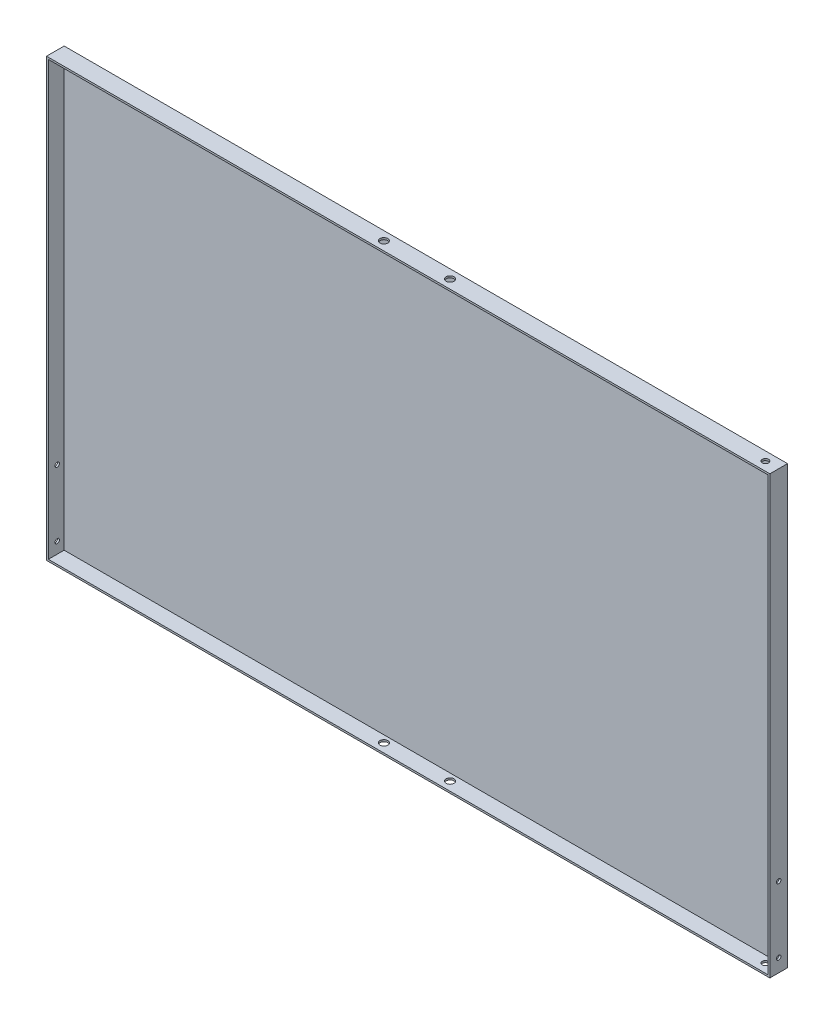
ISO-10303-21;
HEADER;
FILE_DESCRIPTION(('STEP AP214'),'2;1');
FILE_NAME('part.step','',(''),(''),'','','');
FILE_SCHEMA(('AUTOMOTIVE_DESIGN { 1 0 10303 214 1 1 1 1 }'));
ENDSEC;
DATA;
#1=APPLICATION_CONTEXT('core data for automotive mechanical design processes');
#2=APPLICATION_PROTOCOL_DEFINITION('international standard','automotive_design',2000,#1);
#3=PRODUCT_CONTEXT('',#1,'mechanical');
#4=PRODUCT('Part','Part','',(#3));
#5=PRODUCT_RELATED_PRODUCT_CATEGORY('part','',(#4));
#6=PRODUCT_DEFINITION_FORMATION('','',#4);
#7=PRODUCT_DEFINITION_CONTEXT('part definition',#1,'design');
#8=PRODUCT_DEFINITION('design','',#6,#7);
#9=PRODUCT_DEFINITION_SHAPE('','',#8);
#10=(LENGTH_UNIT() NAMED_UNIT(*) SI_UNIT(.MILLI.,.METRE.));
#11=(NAMED_UNIT(*) PLANE_ANGLE_UNIT() SI_UNIT($,.RADIAN.));
#12=(NAMED_UNIT(*) SI_UNIT($,.STERADIAN.) SOLID_ANGLE_UNIT());
#13=UNCERTAINTY_MEASURE_WITH_UNIT(LENGTH_MEASURE(1.E-05),#10,'distance_accuracy_value','');
#14=(GEOMETRIC_REPRESENTATION_CONTEXT(3) GLOBAL_UNCERTAINTY_ASSIGNED_CONTEXT((#13)) GLOBAL_UNIT_ASSIGNED_CONTEXT((#10,
#11,#12)) REPRESENTATION_CONTEXT('',''));
#15=CARTESIAN_POINT('',(0.,0.,0.));
#16=DIRECTION('',(0.,0.,1.));
#17=DIRECTION('',(1.,0.,0.));
#18=AXIS2_PLACEMENT_3D('',#15,#16,#17);
#19=CARTESIAN_POINT('',(-820.,-495.,40.));
#20=DIRECTION('',(1.,0.,0.));
#21=DIRECTION('',(0.,0.,-1.));
#22=AXIS2_PLACEMENT_3D('',#19,#20,#21);
#23=PLANE('',#22);
#24=CARTESIAN_POINT('',(-820.,-315.,19.9999999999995));
#25=DIRECTION('',(1.,0.,0.));
#26=DIRECTION('',(0.,0.,-1.));
#27=AXIS2_PLACEMENT_3D('',#24,#25,#26);
#28=CIRCLE('',#27,5.);
#29=CARTESIAN_POINT('',(-820.,-315.,24.9999999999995));
#30=VERTEX_POINT('',#29);
#31=EDGE_CURVE('E185',#30,#30,#28,.T.);
#32=ORIENTED_EDGE('',*,*,#31,.T.);
#33=EDGE_LOOP('',(#32));
#34=FACE_BOUND('',#33,.T.);
#35=CARTESIAN_POINT('',(-820.,-465.,20.));
#36=DIRECTION('',(1.,0.,0.));
#37=DIRECTION('',(0.,0.,-1.));
#38=AXIS2_PLACEMENT_3D('',#35,#36,#37);
#39=CIRCLE('',#38,5.);
#40=CARTESIAN_POINT('',(-820.,-465.,25.));
#41=VERTEX_POINT('',#40);
#42=EDGE_CURVE('E182',#41,#41,#39,.T.);
#43=ORIENTED_EDGE('',*,*,#42,.T.);
#44=EDGE_LOOP('',(#43));
#45=FACE_BOUND('',#44,.T.);
#46=DIRECTION('',(0.,-1.,0.));
#47=VECTOR('',#46,1.);
#48=CARTESIAN_POINT('',(-820.,-495.,0.));
#49=LINE('',#48,#47);
#50=CARTESIAN_POINT('',(-820.,495.,0.));
#51=VERTEX_POINT('',#50);
#52=CARTESIAN_POINT('',(-820.,-495.,0.));
#53=VERTEX_POINT('',#52);
#54=EDGE_CURVE('E149',#51,#53,#49,.T.);
#55=ORIENTED_EDGE('',*,*,#54,.T.);
#56=DIRECTION('',(0.,0.,-1.));
#57=VECTOR('',#56,1.);
#58=CARTESIAN_POINT('',(-820.,-495.,40.));
#59=LINE('',#58,#57);
#60=CARTESIAN_POINT('',(-820.,-495.,40.));
#61=VERTEX_POINT('',#60);
#62=EDGE_CURVE('E11',#61,#53,#59,.T.);
#63=ORIENTED_EDGE('',*,*,#62,.F.);
#64=DIRECTION('',(0.,-1.,0.));
#65=VECTOR('',#64,1.);
#66=CARTESIAN_POINT('',(-820.,-495.,40.));
#67=LINE('',#66,#65);
#68=CARTESIAN_POINT('',(-820.,495.,40.));
#69=VERTEX_POINT('',#68);
#70=EDGE_CURVE('E142',#69,#61,#67,.T.);
#71=ORIENTED_EDGE('',*,*,#70,.F.);
#72=DIRECTION('',(0.,0.,-1.));
#73=VECTOR('',#72,1.);
#74=CARTESIAN_POINT('',(-820.,495.,40.));
#75=LINE('',#74,#73);
#76=EDGE_CURVE('E148',#69,#51,#75,.T.);
#77=ORIENTED_EDGE('',*,*,#76,.T.);
#78=EDGE_LOOP('',(#55,#63,#71,#77));
#79=FACE_BOUND('',#78,.T.);
#80=ADVANCED_FACE('F33',(#34,#45,#79),#23,.F.);
#81=CARTESIAN_POINT('',(820.,-495.,40.));
#82=DIRECTION('',(0.,1.,0.));
#83=DIRECTION('',(-1.,0.,0.));
#84=AXIS2_PLACEMENT_3D('',#81,#82,#83);
#85=PLANE('',#84);
#86=CARTESIAN_POINT('',(-74.9999999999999,-495.,19.9999999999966));
#87=DIRECTION('',(0.,1.,0.));
#88=DIRECTION('',(-1.,0.,0.));
#89=AXIS2_PLACEMENT_3D('',#86,#87,#88);
#90=CIRCLE('',#89,8.95251953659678);
#91=CARTESIAN_POINT('',(-83.9525195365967,-495.,19.9999999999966));
#92=VERTEX_POINT('',#91);
#93=EDGE_CURVE('E171',#92,#92,#90,.T.);
#94=ORIENTED_EDGE('',*,*,#93,.T.);
#95=EDGE_LOOP('',(#94));
#96=FACE_BOUND('',#95,.T.);
#97=CARTESIAN_POINT('',(75.0000000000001,-495.,19.9999999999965));
#98=DIRECTION('',(0.,1.,0.));
#99=DIRECTION('',(1.,0.,0.));
#100=AXIS2_PLACEMENT_3D('',#97,#98,#99);
#101=CIRCLE('',#100,8.95251953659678);
#102=CARTESIAN_POINT('',(83.9525195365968,-495.,19.9999999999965));
#103=VERTEX_POINT('',#102);
#104=EDGE_CURVE('E202',#103,#103,#101,.T.);
#105=ORIENTED_EDGE('',*,*,#104,.T.);
#106=EDGE_LOOP('',(#105));
#107=FACE_BOUND('',#106,.T.);
#108=CARTESIAN_POINT('',(790.,-495.,19.9999999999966));
#109=DIRECTION('',(0.,1.,0.));
#110=DIRECTION('',(-1.,0.,0.));
#111=AXIS2_PLACEMENT_3D('',#108,#109,#110);
#112=CIRCLE('',#111,7.18021218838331);
#113=CARTESIAN_POINT('',(782.819787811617,-495.,19.9999999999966));
#114=VERTEX_POINT('',#113);
#115=EDGE_CURVE('E166',#114,#114,#112,.T.);
#116=ORIENTED_EDGE('',*,*,#115,.T.);
#117=EDGE_LOOP('',(#116));
#118=FACE_BOUND('',#117,.T.);
#119=DIRECTION('',(1.,0.,0.));
#120=VECTOR('',#119,1.);
#121=CARTESIAN_POINT('',(820.,-495.,0.));
#122=LINE('',#121,#120);
#123=CARTESIAN_POINT('',(820.,-495.,0.));
#124=VERTEX_POINT('',#123);
#125=EDGE_CURVE('E152',#53,#124,#122,.T.);
#126=ORIENTED_EDGE('',*,*,#125,.T.);
#127=DIRECTION('',(0.,0.,-1.));
#128=VECTOR('',#127,1.);
#129=CARTESIAN_POINT('',(820.,-495.,40.));
#130=LINE('',#129,#128);
#131=CARTESIAN_POINT('',(820.,-495.,40.));
#132=VERTEX_POINT('',#131);
#133=EDGE_CURVE('E41',#132,#124,#130,.T.);
#134=ORIENTED_EDGE('',*,*,#133,.F.);
#135=DIRECTION('',(1.,0.,0.));
#136=VECTOR('',#135,1.);
#137=CARTESIAN_POINT('',(820.,-495.,40.));
#138=LINE('',#137,#136);
#139=EDGE_CURVE('E86',#61,#132,#138,.T.);
#140=ORIENTED_EDGE('',*,*,#139,.F.);
#141=ORIENTED_EDGE('',*,*,#62,.T.);
#142=EDGE_LOOP('',(#126,#134,#140,#141));
#143=FACE_BOUND('',#142,.T.);
#144=ADVANCED_FACE('F237',(#96,#107,#118,#143),#85,.F.);
#145=CARTESIAN_POINT('',(820.,-495.,40.));
#146=DIRECTION('',(-1.,0.,0.));
#147=DIRECTION('',(0.,0.,1.));
#148=AXIS2_PLACEMENT_3D('',#145,#146,#147);
#149=PLANE('',#148);
#150=CARTESIAN_POINT('',(820.,-315.,19.9999999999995));
#151=DIRECTION('',(-1.,0.,0.));
#152=DIRECTION('',(0.,0.,1.));
#153=AXIS2_PLACEMENT_3D('',#150,#151,#152);
#154=CIRCLE('',#153,5.);
#155=CARTESIAN_POINT('',(820.,-315.,24.9999999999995));
#156=VERTEX_POINT('',#155);
#157=EDGE_CURVE('E371',#156,#156,#154,.T.);
#158=ORIENTED_EDGE('',*,*,#157,.T.);
#159=EDGE_LOOP('',(#158));
#160=FACE_BOUND('',#159,.T.);
#161=CARTESIAN_POINT('',(820.,-465.,20.));
#162=DIRECTION('',(-1.,0.,0.));
#163=DIRECTION('',(0.,0.,1.));
#164=AXIS2_PLACEMENT_3D('',#161,#162,#163);
#165=CIRCLE('',#164,5.);
#166=CARTESIAN_POINT('',(820.,-465.,25.));
#167=VERTEX_POINT('',#166);
#168=EDGE_CURVE('E178',#167,#167,#165,.T.);
#169=ORIENTED_EDGE('',*,*,#168,.T.);
#170=EDGE_LOOP('',(#169));
#171=FACE_BOUND('',#170,.T.);
#172=DIRECTION('',(0.,1.,0.));
#173=VECTOR('',#172,1.);
#174=CARTESIAN_POINT('',(820.,-495.,0.));
#175=LINE('',#174,#173);
#176=CARTESIAN_POINT('',(820.,495.,0.));
#177=VERTEX_POINT('',#176);
#178=EDGE_CURVE('E154',#124,#177,#175,.T.);
#179=ORIENTED_EDGE('',*,*,#178,.T.);
#180=DIRECTION('',(0.,0.,-1.));
#181=VECTOR('',#180,1.);
#182=CARTESIAN_POINT('',(820.,495.,40.));
#183=LINE('',#182,#181);
#184=CARTESIAN_POINT('',(820.,495.,40.));
#185=VERTEX_POINT('',#184);
#186=EDGE_CURVE('E158',#185,#177,#183,.T.);
#187=ORIENTED_EDGE('',*,*,#186,.F.);
#188=DIRECTION('',(0.,1.,0.));
#189=VECTOR('',#188,1.);
#190=CARTESIAN_POINT('',(820.,-495.,40.));
#191=LINE('',#190,#189);
#192=EDGE_CURVE('E145',#132,#185,#191,.T.);
#193=ORIENTED_EDGE('',*,*,#192,.F.);
#194=ORIENTED_EDGE('',*,*,#133,.T.);
#195=EDGE_LOOP('',(#179,#187,#193,#194));
#196=FACE_BOUND('',#195,.T.);
#197=ADVANCED_FACE('F242',(#160,#171,#196),#149,.F.);
#198=CARTESIAN_POINT('',(820.,495.,40.));
#199=DIRECTION('',(0.,-1.,0.));
#200=DIRECTION('',(1.,0.,0.));
#201=AXIS2_PLACEMENT_3D('',#198,#199,#200);
#202=PLANE('',#201);
#203=CARTESIAN_POINT('',(-75.0000000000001,495.,19.9999999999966));
#204=DIRECTION('',(0.,1.,0.));
#205=DIRECTION('',(-1.,0.,0.));
#206=AXIS2_PLACEMENT_3D('',#203,#204,#205);
#207=CIRCLE('',#206,8.95251953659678);
#208=CARTESIAN_POINT('',(-83.9525195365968,495.,19.9999999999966));
#209=VERTEX_POINT('',#208);
#210=EDGE_CURVE('E199',#209,#209,#207,.T.);
#211=ORIENTED_EDGE('',*,*,#210,.F.);
#212=EDGE_LOOP('',(#211));
#213=FACE_BOUND('',#212,.T.);
#214=CARTESIAN_POINT('',(74.9999999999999,495.,19.9999999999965));
#215=DIRECTION('',(0.,1.,0.));
#216=DIRECTION('',(1.,0.,0.));
#217=AXIS2_PLACEMENT_3D('',#214,#215,#216);
#218=CIRCLE('',#217,8.95251953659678);
#219=CARTESIAN_POINT('',(83.9525195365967,495.,19.9999999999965));
#220=VERTEX_POINT('',#219);
#221=EDGE_CURVE('E196',#220,#220,#218,.T.);
#222=ORIENTED_EDGE('',*,*,#221,.F.);
#223=EDGE_LOOP('',(#222));
#224=FACE_BOUND('',#223,.T.);
#225=CARTESIAN_POINT('',(790.,495.,19.9999999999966));
#226=DIRECTION('',(0.,1.,0.));
#227=DIRECTION('',(-1.,0.,0.));
#228=AXIS2_PLACEMENT_3D('',#225,#226,#227);
#229=CIRCLE('',#228,7.18021218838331);
#230=CARTESIAN_POINT('',(782.819787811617,495.,19.9999999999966));
#231=VERTEX_POINT('',#230);
#232=EDGE_CURVE('E211',#231,#231,#229,.T.);
#233=ORIENTED_EDGE('',*,*,#232,.F.);
#234=EDGE_LOOP('',(#233));
#235=FACE_BOUND('',#234,.T.);
#236=DIRECTION('',(-1.,0.,0.));
#237=VECTOR('',#236,1.);
#238=CARTESIAN_POINT('',(820.,495.,0.));
#239=LINE('',#238,#237);
#240=EDGE_CURVE('E79',#177,#51,#239,.T.);
#241=ORIENTED_EDGE('',*,*,#240,.T.);
#242=ORIENTED_EDGE('',*,*,#76,.F.);
#243=DIRECTION('',(-1.,0.,0.));
#244=VECTOR('',#243,1.);
#245=CARTESIAN_POINT('',(820.,495.,40.));
#246=LINE('',#245,#244);
#247=EDGE_CURVE('E58',#185,#69,#246,.T.);
#248=ORIENTED_EDGE('',*,*,#247,.F.);
#249=ORIENTED_EDGE('',*,*,#186,.T.);
#250=EDGE_LOOP('',(#241,#242,#248,#249));
#251=FACE_BOUND('',#250,.T.);
#252=ADVANCED_FACE('F231',(#213,#224,#235,#251),#202,.F.);
#253=CARTESIAN_POINT('',(0.,0.,40.));
#254=DIRECTION('',(0.,0.,1.));
#255=DIRECTION('',(1.,0.,0.));
#256=AXIS2_PLACEMENT_3D('',#253,#254,#255);
#257=PLANE('',#256);
#258=DIRECTION('',(0.,-1.,0.));
#259=VECTOR('',#258,1.);
#260=CARTESIAN_POINT('',(-815.775639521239,-495.,40.));
#261=LINE('',#260,#259);
#262=CARTESIAN_POINT('',(-815.775639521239,490.775639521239,40.));
#263=VERTEX_POINT('',#262);
#264=CARTESIAN_POINT('',(-815.775639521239,-490.775639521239,40.));
#265=VERTEX_POINT('',#264);
#266=EDGE_CURVE('E131',#263,#265,#261,.T.);
#267=ORIENTED_EDGE('',*,*,#266,.F.);
#268=DIRECTION('',(-1.,0.,0.));
#269=VECTOR('',#268,1.);
#270=CARTESIAN_POINT('',(820.,490.775639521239,40.));
#271=LINE('',#270,#269);
#272=CARTESIAN_POINT('',(815.775639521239,490.775639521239,40.));
#273=VERTEX_POINT('',#272);
#274=EDGE_CURVE('E140',#273,#263,#271,.T.);
#275=ORIENTED_EDGE('',*,*,#274,.F.);
#276=DIRECTION('',(0.,1.,0.));
#277=VECTOR('',#276,1.);
#278=CARTESIAN_POINT('',(815.775639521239,-495.,40.));
#279=LINE('',#278,#277);
#280=CARTESIAN_POINT('',(815.775639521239,-490.775639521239,40.));
#281=VERTEX_POINT('',#280);
#282=EDGE_CURVE('E138',#281,#273,#279,.T.);
#283=ORIENTED_EDGE('',*,*,#282,.F.);
#284=DIRECTION('',(1.,0.,0.));
#285=VECTOR('',#284,1.);
#286=CARTESIAN_POINT('',(820.,-490.775639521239,40.));
#287=LINE('',#286,#285);
#288=EDGE_CURVE('E123',#265,#281,#287,.T.);
#289=ORIENTED_EDGE('',*,*,#288,.F.);
#290=EDGE_LOOP('',(#267,#275,#283,#289));
#291=FACE_BOUND('',#290,.T.);
#292=ORIENTED_EDGE('',*,*,#70,.T.);
#293=ORIENTED_EDGE('',*,*,#139,.T.);
#294=ORIENTED_EDGE('',*,*,#192,.T.);
#295=ORIENTED_EDGE('',*,*,#247,.T.);
#296=EDGE_LOOP('',(#292,#293,#294,#295));
#297=FACE_BOUND('',#296,.T.);
#298=ADVANCED_FACE('F228',(#291,#297),#257,.T.);
#299=CARTESIAN_POINT('',(0.,0.,0.));
#300=DIRECTION('',(0.,0.,1.));
#301=DIRECTION('',(1.,0.,0.));
#302=AXIS2_PLACEMENT_3D('',#299,#300,#301);
#303=PLANE('',#302);
#304=ORIENTED_EDGE('',*,*,#54,.F.);
#305=ORIENTED_EDGE('',*,*,#240,.F.);
#306=ORIENTED_EDGE('',*,*,#178,.F.);
#307=ORIENTED_EDGE('',*,*,#125,.F.);
#308=EDGE_LOOP('',(#304,#305,#306,#307));
#309=FACE_BOUND('',#308,.T.);
#310=ADVANCED_FACE('F230',(#309),#303,.F.);
#311=CARTESIAN_POINT('',(-815.775639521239,-495.,40.));
#312=DIRECTION('',(1.,0.,0.));
#313=DIRECTION('',(0.,0.,-1.));
#314=AXIS2_PLACEMENT_3D('',#311,#312,#313);
#315=PLANE('',#314);
#316=CARTESIAN_POINT('',(-815.775639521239,-315.,19.9999999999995));
#317=DIRECTION('',(1.,0.,0.));
#318=DIRECTION('',(0.,0.,-1.));
#319=AXIS2_PLACEMENT_3D('',#316,#317,#318);
#320=CIRCLE('',#319,5.);
#321=CARTESIAN_POINT('',(-815.775639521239,-315.,24.9999999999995));
#322=VERTEX_POINT('',#321);
#323=EDGE_CURVE('E190',#322,#322,#320,.T.);
#324=ORIENTED_EDGE('',*,*,#323,.F.);
#325=EDGE_LOOP('',(#324));
#326=FACE_BOUND('',#325,.T.);
#327=CARTESIAN_POINT('',(-815.775639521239,-465.,20.));
#328=DIRECTION('',(1.,0.,0.));
#329=DIRECTION('',(0.,0.,-1.));
#330=AXIS2_PLACEMENT_3D('',#327,#328,#329);
#331=CIRCLE('',#330,5.);
#332=CARTESIAN_POINT('',(-815.775639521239,-465.,25.));
#333=VERTEX_POINT('',#332);
#334=EDGE_CURVE('E177',#333,#333,#331,.T.);
#335=ORIENTED_EDGE('',*,*,#334,.F.);
#336=EDGE_LOOP('',(#335));
#337=FACE_BOUND('',#336,.T.);
#338=DIRECTION('',(0.,-1.,0.));
#339=VECTOR('',#338,1.);
#340=CARTESIAN_POINT('',(-815.775639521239,-495.,4.22436047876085));
#341=LINE('',#340,#339);
#342=CARTESIAN_POINT('',(-815.775639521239,490.775639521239,4.22436047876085));
#343=VERTEX_POINT('',#342);
#344=CARTESIAN_POINT('',(-815.775639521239,-490.775639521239,4.22436047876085));
#345=VERTEX_POINT('',#344);
#346=EDGE_CURVE('E114',#343,#345,#341,.T.);
#347=ORIENTED_EDGE('',*,*,#346,.F.);
#348=DIRECTION('',(0.,0.,-1.));
#349=VECTOR('',#348,1.);
#350=CARTESIAN_POINT('',(-815.775639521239,490.775639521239,40.));
#351=LINE('',#350,#349);
#352=EDGE_CURVE('E134',#263,#343,#351,.T.);
#353=ORIENTED_EDGE('',*,*,#352,.F.);
#354=ORIENTED_EDGE('',*,*,#266,.T.);
#355=DIRECTION('',(0.,0.,-1.));
#356=VECTOR('',#355,1.);
#357=CARTESIAN_POINT('',(-815.775639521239,-490.775639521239,40.));
#358=LINE('',#357,#356);
#359=EDGE_CURVE('E126',#265,#345,#358,.T.);
#360=ORIENTED_EDGE('',*,*,#359,.T.);
#361=EDGE_LOOP('',(#347,#353,#354,#360));
#362=FACE_BOUND('',#361,.T.);
#363=ADVANCED_FACE('F226',(#326,#337,#362),#315,.T.);
#364=CARTESIAN_POINT('',(820.,-490.775639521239,40.));
#365=DIRECTION('',(0.,1.,0.));
#366=DIRECTION('',(-1.,0.,0.));
#367=AXIS2_PLACEMENT_3D('',#364,#365,#366);
#368=PLANE('',#367);
#369=CARTESIAN_POINT('',(-74.9999999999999,-490.775639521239,19.9999999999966));
#370=DIRECTION('',(0.,1.,0.));
#371=DIRECTION('',(-1.,0.,0.));
#372=AXIS2_PLACEMENT_3D('',#369,#370,#371);
#373=CIRCLE('',#372,8.95251953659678);
#374=CARTESIAN_POINT('',(-83.9525195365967,-490.775639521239,19.9999999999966));
#375=VERTEX_POINT('',#374);
#376=EDGE_CURVE('E174',#375,#375,#373,.T.);
#377=ORIENTED_EDGE('',*,*,#376,.F.);
#378=EDGE_LOOP('',(#377));
#379=FACE_BOUND('',#378,.T.);
#380=CARTESIAN_POINT('',(75.0000000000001,-490.775639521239,19.9999999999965));
#381=DIRECTION('',(0.,1.,0.));
#382=DIRECTION('',(-1.,0.,0.));
#383=AXIS2_PLACEMENT_3D('',#380,#381,#382);
#384=CIRCLE('',#383,8.95251953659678);
#385=CARTESIAN_POINT('',(66.0474804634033,-490.775639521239,19.9999999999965));
#386=VERTEX_POINT('',#385);
#387=EDGE_CURVE('E170',#386,#386,#384,.T.);
#388=ORIENTED_EDGE('',*,*,#387,.F.);
#389=EDGE_LOOP('',(#388));
#390=FACE_BOUND('',#389,.T.);
#391=CARTESIAN_POINT('',(790.,-490.775639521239,19.9999999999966));
#392=DIRECTION('',(0.,1.,0.));
#393=DIRECTION('',(-1.,0.,0.));
#394=AXIS2_PLACEMENT_3D('',#391,#392,#393);
#395=CIRCLE('',#394,7.18021218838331);
#396=CARTESIAN_POINT('',(782.819787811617,-490.775639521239,19.9999999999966));
#397=VERTEX_POINT('',#396);
#398=EDGE_CURVE('E165',#397,#397,#395,.T.);
#399=ORIENTED_EDGE('',*,*,#398,.F.);
#400=EDGE_LOOP('',(#399));
#401=FACE_BOUND('',#400,.T.);
#402=DIRECTION('',(1.,0.,0.));
#403=VECTOR('',#402,1.);
#404=CARTESIAN_POINT('',(820.,-490.775639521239,4.22436047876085));
#405=LINE('',#404,#403);
#406=CARTESIAN_POINT('',(815.775639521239,-490.775639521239,4.22436047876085));
#407=VERTEX_POINT('',#406);
#408=EDGE_CURVE('E108',#345,#407,#405,.T.);
#409=ORIENTED_EDGE('',*,*,#408,.F.);
#410=ORIENTED_EDGE('',*,*,#359,.F.);
#411=ORIENTED_EDGE('',*,*,#288,.T.);
#412=DIRECTION('',(0.,0.,-1.));
#413=VECTOR('',#412,1.);
#414=CARTESIAN_POINT('',(815.775639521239,-490.775639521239,40.));
#415=LINE('',#414,#413);
#416=EDGE_CURVE('E120',#281,#407,#415,.T.);
#417=ORIENTED_EDGE('',*,*,#416,.T.);
#418=EDGE_LOOP('',(#409,#410,#411,#417));
#419=FACE_BOUND('',#418,.T.);
#420=ADVANCED_FACE('F121',(#379,#390,#401,#419),#368,.T.);
#421=CARTESIAN_POINT('',(815.775639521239,-495.,40.));
#422=DIRECTION('',(-1.,0.,0.));
#423=DIRECTION('',(0.,0.,1.));
#424=AXIS2_PLACEMENT_3D('',#421,#422,#423);
#425=PLANE('',#424);
#426=CARTESIAN_POINT('',(815.775639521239,-315.,19.9999999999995));
#427=DIRECTION('',(-1.,0.,0.));
#428=DIRECTION('',(0.,0.,1.));
#429=AXIS2_PLACEMENT_3D('',#426,#427,#428);
#430=CIRCLE('',#429,5.);
#431=CARTESIAN_POINT('',(815.775639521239,-315.,24.9999999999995));
#432=VERTEX_POINT('',#431);
#433=EDGE_CURVE('E36',#432,#432,#430,.T.);
#434=ORIENTED_EDGE('',*,*,#433,.F.);
#435=EDGE_LOOP('',(#434));
#436=FACE_BOUND('',#435,.T.);
#437=CARTESIAN_POINT('',(815.775639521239,-465.,20.));
#438=DIRECTION('',(-1.,0.,0.));
#439=DIRECTION('',(0.,0.,1.));
#440=AXIS2_PLACEMENT_3D('',#437,#438,#439);
#441=CIRCLE('',#440,5.);
#442=CARTESIAN_POINT('',(815.775639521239,-465.,25.));
#443=VERTEX_POINT('',#442);
#444=EDGE_CURVE('E175',#443,#443,#441,.T.);
#445=ORIENTED_EDGE('',*,*,#444,.F.);
#446=EDGE_LOOP('',(#445));
#447=FACE_BOUND('',#446,.T.);
#448=DIRECTION('',(0.,1.,0.));
#449=VECTOR('',#448,1.);
#450=CARTESIAN_POINT('',(815.775639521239,-495.,4.22436047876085));
#451=LINE('',#450,#449);
#452=CARTESIAN_POINT('',(815.775639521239,490.775639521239,4.22436047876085));
#453=VERTEX_POINT('',#452);
#454=EDGE_CURVE('E112',#407,#453,#451,.T.);
#455=ORIENTED_EDGE('',*,*,#454,.F.);
#456=ORIENTED_EDGE('',*,*,#416,.F.);
#457=ORIENTED_EDGE('',*,*,#282,.T.);
#458=DIRECTION('',(0.,0.,-1.));
#459=VECTOR('',#458,1.);
#460=CARTESIAN_POINT('',(815.775639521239,490.775639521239,40.));
#461=LINE('',#460,#459);
#462=EDGE_CURVE('E49',#273,#453,#461,.T.);
#463=ORIENTED_EDGE('',*,*,#462,.T.);
#464=EDGE_LOOP('',(#455,#456,#457,#463));
#465=FACE_BOUND('',#464,.T.);
#466=ADVANCED_FACE('F128',(#436,#447,#465),#425,.T.);
#467=CARTESIAN_POINT('',(820.,490.775639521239,40.));
#468=DIRECTION('',(0.,-1.,0.));
#469=DIRECTION('',(1.,0.,0.));
#470=AXIS2_PLACEMENT_3D('',#467,#468,#469);
#471=PLANE('',#470);
#472=CARTESIAN_POINT('',(-75.0000000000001,490.775639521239,19.9999999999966));
#473=DIRECTION('',(0.,-1.,0.));
#474=DIRECTION('',(1.,0.,0.));
#475=AXIS2_PLACEMENT_3D('',#472,#473,#474);
#476=CIRCLE('',#475,8.95251953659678);
#477=CARTESIAN_POINT('',(-66.0474804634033,490.775639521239,19.9999999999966));
#478=VERTEX_POINT('',#477);
#479=EDGE_CURVE('E172',#478,#478,#476,.T.);
#480=ORIENTED_EDGE('',*,*,#479,.F.);
#481=EDGE_LOOP('',(#480));
#482=FACE_BOUND('',#481,.T.);
#483=CARTESIAN_POINT('',(74.9999999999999,490.775639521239,19.9999999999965));
#484=DIRECTION('',(0.,-1.,0.));
#485=DIRECTION('',(1.,0.,0.));
#486=AXIS2_PLACEMENT_3D('',#483,#484,#485);
#487=CIRCLE('',#486,8.95251953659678);
#488=CARTESIAN_POINT('',(83.9525195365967,490.775639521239,19.9999999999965));
#489=VERTEX_POINT('',#488);
#490=EDGE_CURVE('E167',#489,#489,#487,.T.);
#491=ORIENTED_EDGE('',*,*,#490,.F.);
#492=EDGE_LOOP('',(#491));
#493=FACE_BOUND('',#492,.T.);
#494=CARTESIAN_POINT('',(790.,490.775639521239,19.9999999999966));
#495=DIRECTION('',(0.,-1.,0.));
#496=DIRECTION('',(1.,0.,0.));
#497=AXIS2_PLACEMENT_3D('',#494,#495,#496);
#498=CIRCLE('',#497,7.18021218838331);
#499=CARTESIAN_POINT('',(797.180212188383,490.775639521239,19.9999999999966));
#500=VERTEX_POINT('',#499);
#501=EDGE_CURVE('E162',#500,#500,#498,.T.);
#502=ORIENTED_EDGE('',*,*,#501,.F.);
#503=EDGE_LOOP('',(#502));
#504=FACE_BOUND('',#503,.T.);
#505=DIRECTION('',(-1.,0.,0.));
#506=VECTOR('',#505,1.);
#507=CARTESIAN_POINT('',(820.,490.775639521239,4.22436047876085));
#508=LINE('',#507,#506);
#509=EDGE_CURVE('E129',#453,#343,#508,.T.);
#510=ORIENTED_EDGE('',*,*,#509,.F.);
#511=ORIENTED_EDGE('',*,*,#462,.F.);
#512=ORIENTED_EDGE('',*,*,#274,.T.);
#513=ORIENTED_EDGE('',*,*,#352,.T.);
#514=EDGE_LOOP('',(#510,#511,#512,#513));
#515=FACE_BOUND('',#514,.T.);
#516=ADVANCED_FACE('F222',(#482,#493,#504,#515),#471,.T.);
#517=CARTESIAN_POINT('',(0.,0.,4.22436047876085));
#518=DIRECTION('',(0.,0.,1.));
#519=DIRECTION('',(1.,0.,0.));
#520=AXIS2_PLACEMENT_3D('',#517,#518,#519);
#521=PLANE('',#520);
#522=ORIENTED_EDGE('',*,*,#346,.T.);
#523=ORIENTED_EDGE('',*,*,#408,.T.);
#524=ORIENTED_EDGE('',*,*,#454,.T.);
#525=ORIENTED_EDGE('',*,*,#509,.T.);
#526=EDGE_LOOP('',(#522,#523,#524,#525));
#527=FACE_BOUND('',#526,.T.);
#528=ADVANCED_FACE('F110',(#527),#521,.T.);
#529=CARTESIAN_POINT('',(790.,-495.,19.9999999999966));
#530=DIRECTION('',(0.,1.,0.));
#531=DIRECTION('',(-1.,0.,0.));
#532=AXIS2_PLACEMENT_3D('',#529,#530,#531);
#533=CYLINDRICAL_SURFACE('',#532,7.18021218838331);
#534=ORIENTED_EDGE('',*,*,#501,.T.);
#535=EDGE_LOOP('',(#534));
#536=FACE_BOUND('',#535,.T.);
#537=ORIENTED_EDGE('',*,*,#232,.T.);
#538=EDGE_LOOP('',(#537));
#539=FACE_BOUND('',#538,.T.);
#540=ADVANCED_FACE('F287',(#536,#539),#533,.F.);
#541=ORIENTED_EDGE('',*,*,#398,.T.);
#542=EDGE_LOOP('',(#541));
#543=FACE_BOUND('',#542,.T.);
#544=ORIENTED_EDGE('',*,*,#115,.F.);
#545=EDGE_LOOP('',(#544));
#546=FACE_BOUND('',#545,.T.);
#547=ADVANCED_FACE('F285',(#543,#546),#533,.F.);
#548=CARTESIAN_POINT('',(75.0000000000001,-495.,19.9999999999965));
#549=DIRECTION('',(0.,1.,0.));
#550=DIRECTION('',(-1.,0.,0.));
#551=AXIS2_PLACEMENT_3D('',#548,#549,#550);
#552=CYLINDRICAL_SURFACE('',#551,8.95251953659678);
#553=ORIENTED_EDGE('',*,*,#490,.T.);
#554=EDGE_LOOP('',(#553));
#555=FACE_BOUND('',#554,.T.);
#556=ORIENTED_EDGE('',*,*,#221,.T.);
#557=EDGE_LOOP('',(#556));
#558=FACE_BOUND('',#557,.T.);
#559=ADVANCED_FACE('F281',(#555,#558),#552,.F.);
#560=CARTESIAN_POINT('',(-74.9999999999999,-495.,19.9999999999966));
#561=DIRECTION('',(0.,1.,0.));
#562=DIRECTION('',(-1.,0.,0.));
#563=AXIS2_PLACEMENT_3D('',#560,#561,#562);
#564=CYLINDRICAL_SURFACE('',#563,8.95251953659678);
#565=ORIENTED_EDGE('',*,*,#479,.T.);
#566=EDGE_LOOP('',(#565));
#567=FACE_BOUND('',#566,.T.);
#568=ORIENTED_EDGE('',*,*,#210,.T.);
#569=EDGE_LOOP('',(#568));
#570=FACE_BOUND('',#569,.T.);
#571=ADVANCED_FACE('F277',(#567,#570),#564,.F.);
#572=ORIENTED_EDGE('',*,*,#387,.T.);
#573=EDGE_LOOP('',(#572));
#574=FACE_BOUND('',#573,.T.);
#575=ORIENTED_EDGE('',*,*,#104,.F.);
#576=EDGE_LOOP('',(#575));
#577=FACE_BOUND('',#576,.T.);
#578=ADVANCED_FACE('F280',(#574,#577),#552,.F.);
#579=ORIENTED_EDGE('',*,*,#376,.T.);
#580=EDGE_LOOP('',(#579));
#581=FACE_BOUND('',#580,.T.);
#582=ORIENTED_EDGE('',*,*,#93,.F.);
#583=EDGE_LOOP('',(#582));
#584=FACE_BOUND('',#583,.T.);
#585=ADVANCED_FACE('F275',(#581,#584),#564,.F.);
#586=CARTESIAN_POINT('',(820.,-465.,20.));
#587=DIRECTION('',(-1.,0.,0.));
#588=DIRECTION('',(0.,0.,1.));
#589=AXIS2_PLACEMENT_3D('',#586,#587,#588);
#590=CYLINDRICAL_SURFACE('',#589,5.);
#591=CARTESIAN_POINT('',(815.775639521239,-465.,25.));
#592=CARTESIAN_POINT('',(815.819643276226,-465.,25.));
#593=CARTESIAN_POINT('',(815.863647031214,-465.,25.));
#594=CARTESIAN_POINT('',(815.951654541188,-465.,25.));
#595=CARTESIAN_POINT('',(815.995658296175,-465.,25.));
#596=CARTESIAN_POINT('',(816.083665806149,-465.,25.));
#597=CARTESIAN_POINT('',(816.127669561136,-465.,25.));
#598=CARTESIAN_POINT('',(816.21567707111,-465.,25.));
#599=CARTESIAN_POINT('',(816.259680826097,-465.,25.));
#600=CARTESIAN_POINT('',(816.347688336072,-465.,25.));
#601=CARTESIAN_POINT('',(816.391692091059,-465.,25.));
#602=CARTESIAN_POINT('',(816.479699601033,-465.,25.));
#603=CARTESIAN_POINT('',(816.52370335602,-465.,25.));
#604=CARTESIAN_POINT('',(816.611710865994,-465.,25.));
#605=CARTESIAN_POINT('',(816.655714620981,-465.,25.));
#606=CARTESIAN_POINT('',(816.743722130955,-465.,25.));
#607=CARTESIAN_POINT('',(816.787725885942,-465.,25.));
#608=CARTESIAN_POINT('',(816.875733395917,-465.,25.));
#609=CARTESIAN_POINT('',(816.919737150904,-465.,25.));
#610=CARTESIAN_POINT('',(817.007744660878,-465.,25.));
#611=CARTESIAN_POINT('',(817.051748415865,-465.,25.));
#612=CARTESIAN_POINT('',(817.139755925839,-465.,25.));
#613=CARTESIAN_POINT('',(817.183759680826,-465.,25.));
#614=CARTESIAN_POINT('',(817.2717671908,-465.,25.));
#615=CARTESIAN_POINT('',(817.315770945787,-465.,25.));
#616=CARTESIAN_POINT('',(817.403778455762,-465.,25.));
#617=CARTESIAN_POINT('',(817.447782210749,-465.,25.));
#618=CARTESIAN_POINT('',(817.535789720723,-465.,25.));
#619=CARTESIAN_POINT('',(817.57979347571,-465.,25.));
#620=CARTESIAN_POINT('',(817.667800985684,-465.,25.));
#621=CARTESIAN_POINT('',(817.711804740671,-465.,25.));
#622=CARTESIAN_POINT('',(817.799812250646,-465.,25.));
#623=CARTESIAN_POINT('',(817.843816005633,-465.,25.));
#624=CARTESIAN_POINT('',(817.931823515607,-465.,25.));
#625=CARTESIAN_POINT('',(817.975827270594,-465.,25.));
#626=CARTESIAN_POINT('',(818.063834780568,-465.,25.));
#627=CARTESIAN_POINT('',(818.107838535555,-465.,25.));
#628=CARTESIAN_POINT('',(818.195846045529,-465.,25.));
#629=CARTESIAN_POINT('',(818.239849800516,-465.,25.));
#630=CARTESIAN_POINT('',(818.327857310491,-465.,25.));
#631=CARTESIAN_POINT('',(818.371861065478,-465.,25.));
#632=CARTESIAN_POINT('',(818.459868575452,-465.,25.));
#633=CARTESIAN_POINT('',(818.503872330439,-465.,25.));
#634=CARTESIAN_POINT('',(818.591879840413,-465.,25.));
#635=CARTESIAN_POINT('',(818.6358835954,-465.,25.));
#636=CARTESIAN_POINT('',(818.723891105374,-465.,25.));
#637=CARTESIAN_POINT('',(818.767894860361,-465.,25.));
#638=CARTESIAN_POINT('',(818.855902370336,-465.,25.));
#639=CARTESIAN_POINT('',(818.899906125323,-465.,25.));
#640=CARTESIAN_POINT('',(818.987913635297,-465.,25.));
#641=CARTESIAN_POINT('',(819.031917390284,-465.,25.));
#642=CARTESIAN_POINT('',(819.119924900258,-465.,25.));
#643=CARTESIAN_POINT('',(819.163928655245,-465.,25.));
#644=CARTESIAN_POINT('',(819.251936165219,-465.,25.));
#645=CARTESIAN_POINT('',(819.295939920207,-465.,25.));
#646=CARTESIAN_POINT('',(819.383947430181,-465.,25.));
#647=CARTESIAN_POINT('',(819.427951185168,-465.,25.));
#648=CARTESIAN_POINT('',(819.515958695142,-465.,25.));
#649=CARTESIAN_POINT('',(819.559962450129,-465.,25.));
#650=CARTESIAN_POINT('',(819.647969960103,-465.,25.));
#651=CARTESIAN_POINT('',(819.691973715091,-465.,25.));
#652=CARTESIAN_POINT('',(819.779981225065,-465.,25.));
#653=CARTESIAN_POINT('',(819.823984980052,-465.,25.));
#654=CARTESIAN_POINT('',(819.911992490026,-465.,25.));
#655=CARTESIAN_POINT('',(819.955996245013,-465.,25.));
#656=CARTESIAN_POINT('',(820.,-465.,25.));
#657=B_SPLINE_CURVE_WITH_KNOTS('',3,(#591,#592,#593,#594,#595,#596,#597,#598,#599,#600,#601,
#602,#603,#604,#605,#606,#607,#608,#609,#610,#611,#612,#613,#614,#615,#616,#617,#618,#619,#620,
#621,#622,#623,#624,#625,#626,#627,#628,#629,#630,#631,#632,#633,#634,#635,#636,#637,#638,#639,
#640,#641,#642,#643,#644,#645,#646,#647,#648,#649,#650,#651,#652,#653,#654,#655,#656),
.UNSPECIFIED.,.F.,.F.,(4,2,2,2,2,2,2,2,2,2,2,2,2,2,2,2,2,2,2,2,2,2,2,2,2,2,2,2,2,2,2,2,4),(0.,
0.132011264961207,0.264022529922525,0.396033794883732,0.52804505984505,0.660056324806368,
0.792067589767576,0.924078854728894,1.05609011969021,1.18810138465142,1.32011264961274,
1.45212391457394,1.58413517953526,1.71614644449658,1.84815770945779,1.98016897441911,
2.11218023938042,2.24419150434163,2.37620276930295,2.50821403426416,2.64022529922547,
2.77223656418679,2.904247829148,3.03625909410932,3.16827035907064,3.30028162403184,
3.43229288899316,3.56430415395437,3.69631541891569,3.828326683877,3.96033794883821,
4.09234921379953,4.22436047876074),.UNSPECIFIED.);
#658=EDGE_CURVE('BSEAM265',#443,#167,#657,.T.);
#659=ORIENTED_EDGE('',*,*,#444,.T.);
#660=ORIENTED_EDGE('',*,*,#168,.F.);
#661=ORIENTED_EDGE('',*,*,#658,.T.);
#662=ORIENTED_EDGE('',*,*,#658,.F.);
#663=EDGE_LOOP('',(#659,#661,#660,#662));
#664=FACE_BOUND('',#663,.T.);
#665=ADVANCED_FACE('F265',(#664),#590,.F.);
#666=CARTESIAN_POINT('',(-815.775639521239,-465.,25.));
#667=CARTESIAN_POINT('',(-815.819643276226,-465.,25.));
#668=CARTESIAN_POINT('',(-815.863647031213,-465.,25.));
#669=CARTESIAN_POINT('',(-815.951654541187,-465.,25.));
#670=CARTESIAN_POINT('',(-815.995658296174,-465.,25.));
#671=CARTESIAN_POINT('',(-816.083665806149,-465.,25.));
#672=CARTESIAN_POINT('',(-816.127669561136,-465.,25.));
#673=CARTESIAN_POINT('',(-816.21567707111,-465.,25.));
#674=CARTESIAN_POINT('',(-816.259680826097,-465.,25.));
#675=CARTESIAN_POINT('',(-816.347688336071,-465.,25.));
#676=CARTESIAN_POINT('',(-816.391692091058,-465.,25.));
#677=CARTESIAN_POINT('',(-816.479699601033,-465.,25.));
#678=CARTESIAN_POINT('',(-816.52370335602,-465.,25.));
#679=CARTESIAN_POINT('',(-816.611710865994,-465.,25.));
#680=CARTESIAN_POINT('',(-816.655714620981,-465.,25.));
#681=CARTESIAN_POINT('',(-816.743722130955,-465.,25.));
#682=CARTESIAN_POINT('',(-816.787725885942,-465.,25.));
#683=CARTESIAN_POINT('',(-816.875733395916,-465.,25.));
#684=CARTESIAN_POINT('',(-816.919737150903,-465.,25.));
#685=CARTESIAN_POINT('',(-817.007744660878,-465.,25.));
#686=CARTESIAN_POINT('',(-817.051748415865,-465.,25.));
#687=CARTESIAN_POINT('',(-817.139755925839,-465.,25.));
#688=CARTESIAN_POINT('',(-817.183759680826,-465.,25.));
#689=CARTESIAN_POINT('',(-817.2717671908,-465.,25.));
#690=CARTESIAN_POINT('',(-817.315770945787,-465.,25.));
#691=CARTESIAN_POINT('',(-817.403778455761,-465.,25.));
#692=CARTESIAN_POINT('',(-817.447782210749,-465.,25.));
#693=CARTESIAN_POINT('',(-817.535789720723,-465.,25.));
#694=CARTESIAN_POINT('',(-817.57979347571,-465.,25.));
#695=CARTESIAN_POINT('',(-817.667800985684,-465.,25.));
#696=CARTESIAN_POINT('',(-817.711804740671,-465.,25.));
#697=CARTESIAN_POINT('',(-817.799812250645,-465.,25.));
#698=CARTESIAN_POINT('',(-817.843816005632,-465.,25.));
#699=CARTESIAN_POINT('',(-817.931823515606,-465.,25.));
#700=CARTESIAN_POINT('',(-817.975827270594,-465.,25.));
#701=CARTESIAN_POINT('',(-818.063834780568,-465.,25.));
#702=CARTESIAN_POINT('',(-818.107838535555,-465.,25.));
#703=CARTESIAN_POINT('',(-818.195846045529,-465.,25.));
#704=CARTESIAN_POINT('',(-818.239849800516,-465.,25.));
#705=CARTESIAN_POINT('',(-818.32785731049,-465.,25.));
#706=CARTESIAN_POINT('',(-818.371861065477,-465.,25.));
#707=CARTESIAN_POINT('',(-818.459868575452,-465.,25.));
#708=CARTESIAN_POINT('',(-818.503872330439,-465.,25.));
#709=CARTESIAN_POINT('',(-818.591879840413,-465.,25.));
#710=CARTESIAN_POINT('',(-818.6358835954,-465.,25.));
#711=CARTESIAN_POINT('',(-818.723891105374,-465.,25.));
#712=CARTESIAN_POINT('',(-818.767894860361,-465.,25.));
#713=CARTESIAN_POINT('',(-818.855902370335,-465.,25.));
#714=CARTESIAN_POINT('',(-818.899906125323,-465.,25.));
#715=CARTESIAN_POINT('',(-818.987913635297,-465.,25.));
#716=CARTESIAN_POINT('',(-819.031917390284,-465.,25.));
#717=CARTESIAN_POINT('',(-819.119924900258,-465.,25.));
#718=CARTESIAN_POINT('',(-819.163928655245,-465.,25.));
#719=CARTESIAN_POINT('',(-819.251936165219,-465.,25.));
#720=CARTESIAN_POINT('',(-819.295939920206,-465.,25.));
#721=CARTESIAN_POINT('',(-819.38394743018,-465.,25.));
#722=CARTESIAN_POINT('',(-819.427951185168,-465.,25.));
#723=CARTESIAN_POINT('',(-819.515958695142,-465.,25.));
#724=CARTESIAN_POINT('',(-819.559962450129,-465.,25.));
#725=CARTESIAN_POINT('',(-819.647969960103,-465.,25.));
#726=CARTESIAN_POINT('',(-819.69197371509,-465.,25.));
#727=CARTESIAN_POINT('',(-819.779981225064,-465.,25.));
#728=CARTESIAN_POINT('',(-819.823984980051,-465.,25.));
#729=CARTESIAN_POINT('',(-819.911992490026,-465.,25.));
#730=CARTESIAN_POINT('',(-819.955996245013,-465.,25.));
#731=CARTESIAN_POINT('',(-820.,-465.,25.));
#732=B_SPLINE_CURVE_WITH_KNOTS('',3,(#666,#667,#668,#669,#670,#671,#672,#673,#674,#675,#676,
#677,#678,#679,#680,#681,#682,#683,#684,#685,#686,#687,#688,#689,#690,#691,#692,#693,#694,#695,
#696,#697,#698,#699,#700,#701,#702,#703,#704,#705,#706,#707,#708,#709,#710,#711,#712,#713,#714,
#715,#716,#717,#718,#719,#720,#721,#722,#723,#724,#725,#726,#727,#728,#729,#730,#731),
.UNSPECIFIED.,.F.,.F.,(4,2,2,2,2,2,2,2,2,2,2,2,2,2,2,2,2,2,2,2,2,2,2,2,2,2,2,2,2,2,2,2,4),(0.,
0.132011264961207,0.264022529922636,0.396033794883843,0.52804505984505,0.660056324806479,
0.792067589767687,0.924078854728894,1.0560901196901,1.18810138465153,1.32011264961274,
1.45212391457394,1.58413517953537,1.71614644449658,1.84815770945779,1.98016897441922,
2.11218023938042,2.24419150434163,2.37620276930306,2.50821403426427,2.64022529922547,
2.7722365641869,2.90424782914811,3.03625909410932,3.16827035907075,3.30028162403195,
3.43229288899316,3.56430415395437,3.6963154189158,3.828326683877,3.96033794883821,
4.09234921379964,4.22436047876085),.UNSPECIFIED.);
#733=EDGE_CURVE('BSEAM262',#333,#41,#732,.T.);
#734=ORIENTED_EDGE('',*,*,#334,.T.);
#735=ORIENTED_EDGE('',*,*,#42,.F.);
#736=ORIENTED_EDGE('',*,*,#733,.T.);
#737=ORIENTED_EDGE('',*,*,#733,.F.);
#738=EDGE_LOOP('',(#734,#736,#735,#737));
#739=FACE_BOUND('',#738,.T.);
#740=ADVANCED_FACE('F262',(#739),#590,.F.);
#741=CARTESIAN_POINT('',(820.,-315.,19.9999999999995));
#742=DIRECTION('',(-1.,0.,0.));
#743=DIRECTION('',(0.,0.,1.));
#744=AXIS2_PLACEMENT_3D('',#741,#742,#743);
#745=CYLINDRICAL_SURFACE('',#744,5.);
#746=CARTESIAN_POINT('',(815.775639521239,-315.,24.9999999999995));
#747=CARTESIAN_POINT('',(815.819643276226,-315.,24.9999999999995));
#748=CARTESIAN_POINT('',(815.863647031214,-315.,24.9999999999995));
#749=CARTESIAN_POINT('',(815.951654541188,-315.,24.9999999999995));
#750=CARTESIAN_POINT('',(815.995658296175,-315.,24.9999999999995));
#751=CARTESIAN_POINT('',(816.083665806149,-315.,24.9999999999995));
#752=CARTESIAN_POINT('',(816.127669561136,-315.,24.9999999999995));
#753=CARTESIAN_POINT('',(816.21567707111,-315.,24.9999999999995));
#754=CARTESIAN_POINT('',(816.259680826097,-315.,24.9999999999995));
#755=CARTESIAN_POINT('',(816.347688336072,-315.,24.9999999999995));
#756=CARTESIAN_POINT('',(816.391692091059,-315.,24.9999999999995));
#757=CARTESIAN_POINT('',(816.479699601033,-315.,24.9999999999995));
#758=CARTESIAN_POINT('',(816.52370335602,-315.,24.9999999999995));
#759=CARTESIAN_POINT('',(816.611710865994,-315.,24.9999999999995));
#760=CARTESIAN_POINT('',(816.655714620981,-315.,24.9999999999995));
#761=CARTESIAN_POINT('',(816.743722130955,-315.,24.9999999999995));
#762=CARTESIAN_POINT('',(816.787725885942,-315.,24.9999999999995));
#763=CARTESIAN_POINT('',(816.875733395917,-315.,24.9999999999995));
#764=CARTESIAN_POINT('',(816.919737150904,-315.,24.9999999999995));
#765=CARTESIAN_POINT('',(817.007744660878,-315.,24.9999999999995));
#766=CARTESIAN_POINT('',(817.051748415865,-315.,24.9999999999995));
#767=CARTESIAN_POINT('',(817.139755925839,-315.,24.9999999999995));
#768=CARTESIAN_POINT('',(817.183759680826,-315.,24.9999999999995));
#769=CARTESIAN_POINT('',(817.2717671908,-315.,24.9999999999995));
#770=CARTESIAN_POINT('',(817.315770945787,-315.,24.9999999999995));
#771=CARTESIAN_POINT('',(817.403778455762,-315.,24.9999999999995));
#772=CARTESIAN_POINT('',(817.447782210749,-315.,24.9999999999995));
#773=CARTESIAN_POINT('',(817.535789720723,-315.,24.9999999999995));
#774=CARTESIAN_POINT('',(817.57979347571,-315.,24.9999999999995));
#775=CARTESIAN_POINT('',(817.667800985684,-315.,24.9999999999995));
#776=CARTESIAN_POINT('',(817.711804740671,-315.,24.9999999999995));
#777=CARTESIAN_POINT('',(817.799812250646,-315.,24.9999999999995));
#778=CARTESIAN_POINT('',(817.843816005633,-315.,24.9999999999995));
#779=CARTESIAN_POINT('',(817.931823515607,-315.,24.9999999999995));
#780=CARTESIAN_POINT('',(817.975827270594,-315.,24.9999999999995));
#781=CARTESIAN_POINT('',(818.063834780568,-315.,24.9999999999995));
#782=CARTESIAN_POINT('',(818.107838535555,-315.,24.9999999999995));
#783=CARTESIAN_POINT('',(818.195846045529,-315.,24.9999999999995));
#784=CARTESIAN_POINT('',(818.239849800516,-315.,24.9999999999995));
#785=CARTESIAN_POINT('',(818.327857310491,-315.,24.9999999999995));
#786=CARTESIAN_POINT('',(818.371861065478,-315.,24.9999999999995));
#787=CARTESIAN_POINT('',(818.459868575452,-315.,24.9999999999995));
#788=CARTESIAN_POINT('',(818.503872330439,-315.,24.9999999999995));
#789=CARTESIAN_POINT('',(818.591879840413,-315.,24.9999999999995));
#790=CARTESIAN_POINT('',(818.6358835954,-315.,24.9999999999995));
#791=CARTESIAN_POINT('',(818.723891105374,-315.,24.9999999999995));
#792=CARTESIAN_POINT('',(818.767894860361,-315.,24.9999999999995));
#793=CARTESIAN_POINT('',(818.855902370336,-315.,24.9999999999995));
#794=CARTESIAN_POINT('',(818.899906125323,-315.,24.9999999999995));
#795=CARTESIAN_POINT('',(818.987913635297,-315.,24.9999999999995));
#796=CARTESIAN_POINT('',(819.031917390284,-315.,24.9999999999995));
#797=CARTESIAN_POINT('',(819.119924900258,-315.,24.9999999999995));
#798=CARTESIAN_POINT('',(819.163928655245,-315.,24.9999999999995));
#799=CARTESIAN_POINT('',(819.251936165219,-315.,24.9999999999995));
#800=CARTESIAN_POINT('',(819.295939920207,-315.,24.9999999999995));
#801=CARTESIAN_POINT('',(819.383947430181,-315.,24.9999999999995));
#802=CARTESIAN_POINT('',(819.427951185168,-315.,24.9999999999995));
#803=CARTESIAN_POINT('',(819.515958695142,-315.,24.9999999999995));
#804=CARTESIAN_POINT('',(819.559962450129,-315.,24.9999999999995));
#805=CARTESIAN_POINT('',(819.647969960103,-315.,24.9999999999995));
#806=CARTESIAN_POINT('',(819.691973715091,-315.,24.9999999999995));
#807=CARTESIAN_POINT('',(819.779981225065,-315.,24.9999999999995));
#808=CARTESIAN_POINT('',(819.823984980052,-315.,24.9999999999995));
#809=CARTESIAN_POINT('',(819.911992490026,-315.,24.9999999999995));
#810=CARTESIAN_POINT('',(819.955996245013,-315.,24.9999999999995));
#811=CARTESIAN_POINT('',(820.,-315.,24.9999999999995));
#812=B_SPLINE_CURVE_WITH_KNOTS('',3,(#746,#747,#748,#749,#750,#751,#752,#753,#754,#755,#756,
#757,#758,#759,#760,#761,#762,#763,#764,#765,#766,#767,#768,#769,#770,#771,#772,#773,#774,#775,
#776,#777,#778,#779,#780,#781,#782,#783,#784,#785,#786,#787,#788,#789,#790,#791,#792,#793,#794,
#795,#796,#797,#798,#799,#800,#801,#802,#803,#804,#805,#806,#807,#808,#809,#810,#811),
.UNSPECIFIED.,.F.,.F.,(4,2,2,2,2,2,2,2,2,2,2,2,2,2,2,2,2,2,2,2,2,2,2,2,2,2,2,2,2,2,2,2,4),(0.,
0.132011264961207,0.264022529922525,0.396033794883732,0.52804505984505,0.660056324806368,
0.792067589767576,0.924078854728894,1.05609011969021,1.18810138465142,1.32011264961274,
1.45212391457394,1.58413517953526,1.71614644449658,1.84815770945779,1.98016897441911,
2.11218023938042,2.24419150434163,2.37620276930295,2.50821403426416,2.64022529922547,
2.77223656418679,2.904247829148,3.03625909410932,3.16827035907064,3.30028162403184,
3.43229288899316,3.56430415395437,3.69631541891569,3.828326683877,3.96033794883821,
4.09234921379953,4.22436047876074),.UNSPECIFIED.);
#813=EDGE_CURVE('BSEAM264',#432,#156,#812,.T.);
#814=ORIENTED_EDGE('',*,*,#433,.T.);
#815=ORIENTED_EDGE('',*,*,#157,.F.);
#816=ORIENTED_EDGE('',*,*,#813,.T.);
#817=ORIENTED_EDGE('',*,*,#813,.F.);
#818=EDGE_LOOP('',(#814,#816,#815,#817));
#819=FACE_BOUND('',#818,.T.);
#820=ADVANCED_FACE('F264',(#819),#745,.F.);
#821=CARTESIAN_POINT('',(-815.775639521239,-315.,24.9999999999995));
#822=CARTESIAN_POINT('',(-815.819643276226,-315.,24.9999999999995));
#823=CARTESIAN_POINT('',(-815.863647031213,-315.,24.9999999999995));
#824=CARTESIAN_POINT('',(-815.951654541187,-315.,24.9999999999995));
#825=CARTESIAN_POINT('',(-815.995658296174,-315.,24.9999999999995));
#826=CARTESIAN_POINT('',(-816.083665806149,-315.,24.9999999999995));
#827=CARTESIAN_POINT('',(-816.127669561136,-315.,24.9999999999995));
#828=CARTESIAN_POINT('',(-816.21567707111,-315.,24.9999999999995));
#829=CARTESIAN_POINT('',(-816.259680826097,-315.,24.9999999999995));
#830=CARTESIAN_POINT('',(-816.347688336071,-315.,24.9999999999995));
#831=CARTESIAN_POINT('',(-816.391692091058,-315.,24.9999999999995));
#832=CARTESIAN_POINT('',(-816.479699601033,-315.,24.9999999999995));
#833=CARTESIAN_POINT('',(-816.52370335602,-315.,24.9999999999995));
#834=CARTESIAN_POINT('',(-816.611710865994,-315.,24.9999999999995));
#835=CARTESIAN_POINT('',(-816.655714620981,-315.,24.9999999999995));
#836=CARTESIAN_POINT('',(-816.743722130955,-315.,24.9999999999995));
#837=CARTESIAN_POINT('',(-816.787725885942,-315.,24.9999999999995));
#838=CARTESIAN_POINT('',(-816.875733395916,-315.,24.9999999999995));
#839=CARTESIAN_POINT('',(-816.919737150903,-315.,24.9999999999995));
#840=CARTESIAN_POINT('',(-817.007744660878,-315.,24.9999999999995));
#841=CARTESIAN_POINT('',(-817.051748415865,-315.,24.9999999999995));
#842=CARTESIAN_POINT('',(-817.139755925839,-315.,24.9999999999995));
#843=CARTESIAN_POINT('',(-817.183759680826,-315.,24.9999999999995));
#844=CARTESIAN_POINT('',(-817.2717671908,-315.,24.9999999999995));
#845=CARTESIAN_POINT('',(-817.315770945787,-315.,24.9999999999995));
#846=CARTESIAN_POINT('',(-817.403778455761,-315.,24.9999999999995));
#847=CARTESIAN_POINT('',(-817.447782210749,-315.,24.9999999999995));
#848=CARTESIAN_POINT('',(-817.535789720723,-315.,24.9999999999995));
#849=CARTESIAN_POINT('',(-817.57979347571,-315.,24.9999999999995));
#850=CARTESIAN_POINT('',(-817.667800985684,-315.,24.9999999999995));
#851=CARTESIAN_POINT('',(-817.711804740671,-315.,24.9999999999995));
#852=CARTESIAN_POINT('',(-817.799812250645,-315.,24.9999999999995));
#853=CARTESIAN_POINT('',(-817.843816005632,-315.,24.9999999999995));
#854=CARTESIAN_POINT('',(-817.931823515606,-315.,24.9999999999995));
#855=CARTESIAN_POINT('',(-817.975827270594,-315.,24.9999999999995));
#856=CARTESIAN_POINT('',(-818.063834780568,-315.,24.9999999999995));
#857=CARTESIAN_POINT('',(-818.107838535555,-315.,24.9999999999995));
#858=CARTESIAN_POINT('',(-818.195846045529,-315.,24.9999999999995));
#859=CARTESIAN_POINT('',(-818.239849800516,-315.,24.9999999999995));
#860=CARTESIAN_POINT('',(-818.32785731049,-315.,24.9999999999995));
#861=CARTESIAN_POINT('',(-818.371861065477,-315.,24.9999999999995));
#862=CARTESIAN_POINT('',(-818.459868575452,-315.,24.9999999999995));
#863=CARTESIAN_POINT('',(-818.503872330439,-315.,24.9999999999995));
#864=CARTESIAN_POINT('',(-818.591879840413,-315.,24.9999999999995));
#865=CARTESIAN_POINT('',(-818.6358835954,-315.,24.9999999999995));
#866=CARTESIAN_POINT('',(-818.723891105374,-315.,24.9999999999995));
#867=CARTESIAN_POINT('',(-818.767894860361,-315.,24.9999999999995));
#868=CARTESIAN_POINT('',(-818.855902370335,-315.,24.9999999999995));
#869=CARTESIAN_POINT('',(-818.899906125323,-315.,24.9999999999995));
#870=CARTESIAN_POINT('',(-818.987913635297,-315.,24.9999999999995));
#871=CARTESIAN_POINT('',(-819.031917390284,-315.,24.9999999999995));
#872=CARTESIAN_POINT('',(-819.119924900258,-315.,24.9999999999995));
#873=CARTESIAN_POINT('',(-819.163928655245,-315.,24.9999999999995));
#874=CARTESIAN_POINT('',(-819.251936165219,-315.,24.9999999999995));
#875=CARTESIAN_POINT('',(-819.295939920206,-315.,24.9999999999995));
#876=CARTESIAN_POINT('',(-819.38394743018,-315.,24.9999999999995));
#877=CARTESIAN_POINT('',(-819.427951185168,-315.,24.9999999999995));
#878=CARTESIAN_POINT('',(-819.515958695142,-315.,24.9999999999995));
#879=CARTESIAN_POINT('',(-819.559962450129,-315.,24.9999999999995));
#880=CARTESIAN_POINT('',(-819.647969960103,-315.,24.9999999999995));
#881=CARTESIAN_POINT('',(-819.69197371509,-315.,24.9999999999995));
#882=CARTESIAN_POINT('',(-819.779981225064,-315.,24.9999999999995));
#883=CARTESIAN_POINT('',(-819.823984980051,-315.,24.9999999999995));
#884=CARTESIAN_POINT('',(-819.911992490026,-315.,24.9999999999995));
#885=CARTESIAN_POINT('',(-819.955996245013,-315.,24.9999999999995));
#886=CARTESIAN_POINT('',(-820.,-315.,24.9999999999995));
#887=B_SPLINE_CURVE_WITH_KNOTS('',3,(#821,#822,#823,#824,#825,#826,#827,#828,#829,#830,#831,
#832,#833,#834,#835,#836,#837,#838,#839,#840,#841,#842,#843,#844,#845,#846,#847,#848,#849,#850,
#851,#852,#853,#854,#855,#856,#857,#858,#859,#860,#861,#862,#863,#864,#865,#866,#867,#868,#869,
#870,#871,#872,#873,#874,#875,#876,#877,#878,#879,#880,#881,#882,#883,#884,#885,#886),
.UNSPECIFIED.,.F.,.F.,(4,2,2,2,2,2,2,2,2,2,2,2,2,2,2,2,2,2,2,2,2,2,2,2,2,2,2,2,2,2,2,2,4),(0.,
0.132011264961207,0.264022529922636,0.396033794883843,0.52804505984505,0.660056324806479,
0.792067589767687,0.924078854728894,1.0560901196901,1.18810138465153,1.32011264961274,
1.45212391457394,1.58413517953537,1.71614644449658,1.84815770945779,1.98016897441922,
2.11218023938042,2.24419150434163,2.37620276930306,2.50821403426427,2.64022529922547,
2.7722365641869,2.90424782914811,3.03625909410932,3.16827035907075,3.30028162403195,
3.43229288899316,3.56430415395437,3.6963154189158,3.828326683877,3.96033794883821,
4.09234921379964,4.22436047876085),.UNSPECIFIED.);
#888=EDGE_CURVE('BSEAM272',#322,#30,#887,.T.);
#889=ORIENTED_EDGE('',*,*,#323,.T.);
#890=ORIENTED_EDGE('',*,*,#31,.F.);
#891=ORIENTED_EDGE('',*,*,#888,.T.);
#892=ORIENTED_EDGE('',*,*,#888,.F.);
#893=EDGE_LOOP('',(#889,#891,#890,#892));
#894=FACE_BOUND('',#893,.T.);
#895=ADVANCED_FACE('F272',(#894),#745,.F.);
#896=CLOSED_SHELL('',(#80,#144,#197,#252,#298,#310,#363,#420,#466,#516,#528,#540,#547,#559,#571,
#578,#585,#665,#740,#820,#895));
#897=MANIFOLD_SOLID_BREP('B2',#896);
#898=ADVANCED_BREP_SHAPE_REPRESENTATION('',(#18,#897),#14);
#899=SHAPE_DEFINITION_REPRESENTATION(#9,#898);
ENDSEC;
END-ISO-10303-21;
